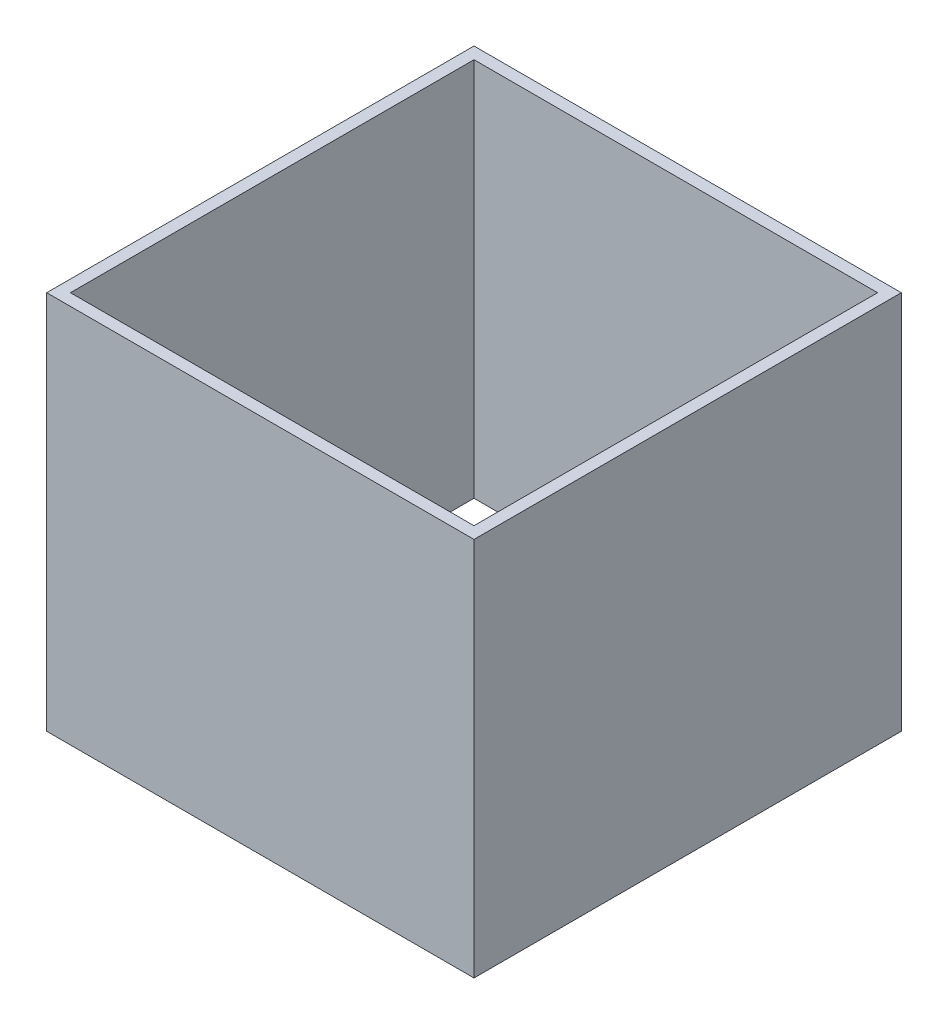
from build123d import *

# Parameters (mm, degrees)
SKETCH2_W           = 180
SKETCH2_H           = 180
SKETCH2_W_2         = 170
SKETCH2_H_2         = 170
BOSS_EXTRUDE1_DEPTH = 160


with BuildPart() as part:
    # Sketch2 → Boss-Extrude1 (new body)
    with BuildSketch(Plane(origin=(0, 0, 0), x_dir=(1, 0, 0), z_dir=(0, 1, 0))):
        with Locations((90, 90)):
            Rectangle(SKETCH2_W, SKETCH2_H)
        with Locations((90, 90)):
            Rectangle(SKETCH2_W_2, SKETCH2_H_2, mode=Mode.SUBTRACT)
    extrude(amount=BOSS_EXTRUDE1_DEPTH)


solid = part.part
